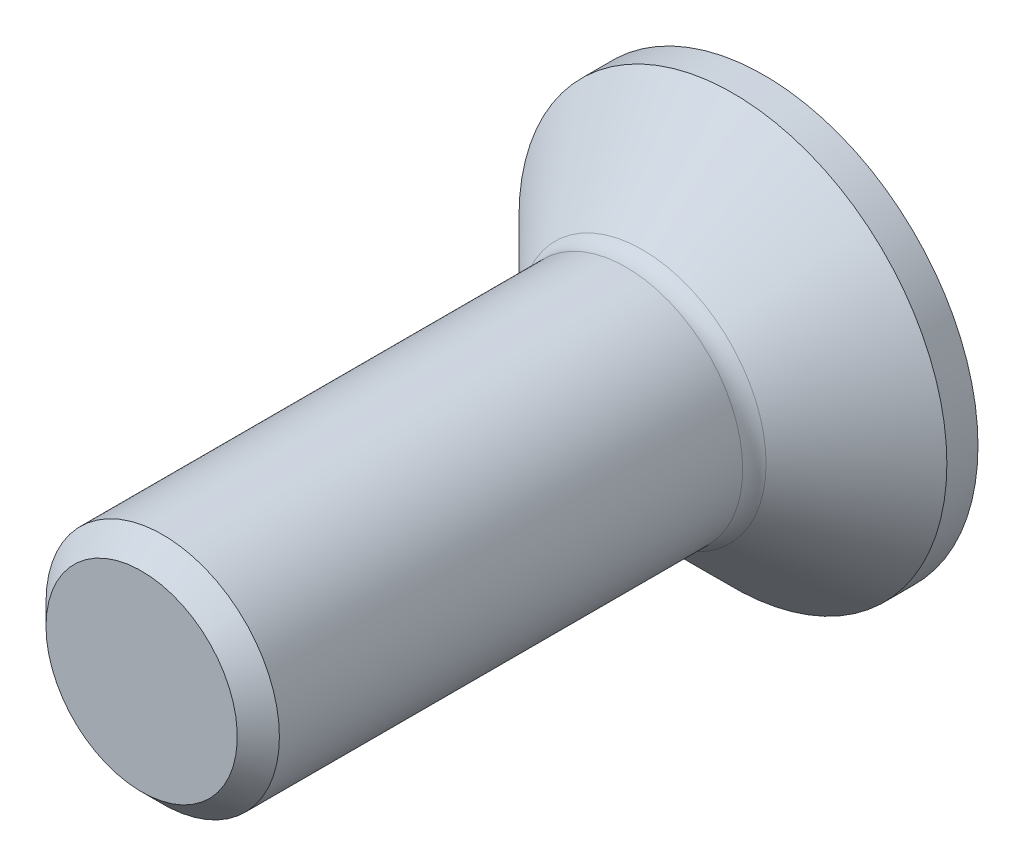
from build123d import *

# Parameters (mm, degrees)
CHAMFER1_SIZE      = 0.270625
FILLET1_R          = 0.3
SKETCH2_OUTSIDE_W  = 10.694
SKETCH2_OUTSIDE_H  = 10.694
SKETCH2_OUTSIDE_R  = 2.75
CUT_EXTRUDE1_DEPTH = 10.156691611
HOLE1_D            = 2
HOLE1_DEPTH        = 1.05
HOLE1_TIP          = 0.577350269
CUT_EXTRUDE2_DEPTH = 1.05


with BuildPart() as part:
    # Sketch1 → Base-Revolve (revolve)
    with BuildSketch(Plane(origin=(0, 0, 0), x_dir=(0, 0, -1), z_dir=(1, 0, 0)), mode=Mode.PRIVATE) as base_revolve_sk:
        Polygon((0, 1.5), (1.65, 3.15), (1.65, 0), (-6.35, 0), (-6.35, 1.5), align=None)
    revolve(base_revolve_sk.sketch.rotate(Axis((0, 0, 6.35), (0, 0, -1)), 90), axis=Axis((0, 0, 6.35), (0, 0, -1)))

    # Chamfer1
    chamfer1_edges = [part.edges().sort_by_distance(p)[0] for p in [
        (-1.5, 0, 6.35),
    ]]
    chamfer(chamfer1_edges, length=CHAMFER1_SIZE)

    # Fillet1
    fillet1_edges = [part.edges().sort_by_distance(p)[0] for p in [
        (-1.5, 0, 0),
    ]]
    fillet(fillet1_edges, radius=FILLET1_R)

    # Sketch2 outside → Cut-Extrude1 (cut, through all)
    with BuildSketch(Plane(origin=(0, 0, -1.65), x_dir=(-1, 0, 0), z_dir=(0, 0, -1))):
        Rectangle(SKETCH2_OUTSIDE_W, SKETCH2_OUTSIDE_H)
        Circle(SKETCH2_OUTSIDE_R, mode=Mode.SUBTRACT)
    extrude(amount=-CUT_EXTRUDE1_DEPTH, mode=Mode.SUBTRACT)

    # Hole1
    with Locations(Plane(origin=(0, 0, -1.65), x_dir=(-1, 0, 0), z_dir=(0, 0, -1))):
        with Locations((0, 0)):
            Hole(HOLE1_D / 2, depth=HOLE1_DEPTH)
            with Locations((0, 0, -(HOLE1_DEPTH + HOLE1_TIP / 2))):  # 120° drill point
                Cone(0, HOLE1_D / 2, HOLE1_TIP, mode=Mode.SUBTRACT)

    # Sketch5 → Cut-Extrude2 (cut)
    with BuildSketch(Plane(origin=(0, 0, -1.65), x_dir=(-1, 0, 0), z_dir=(0, 0, -1))):
        Polygon((-0.577350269, 1), (0.577350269, 1), (1.154700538, 0), (0.577350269, -1), (-0.577350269, -1), (-1.154700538, 0), align=None)
    extrude(amount=-CUT_EXTRUDE2_DEPTH, mode=Mode.SUBTRACT)


solid = part.part
